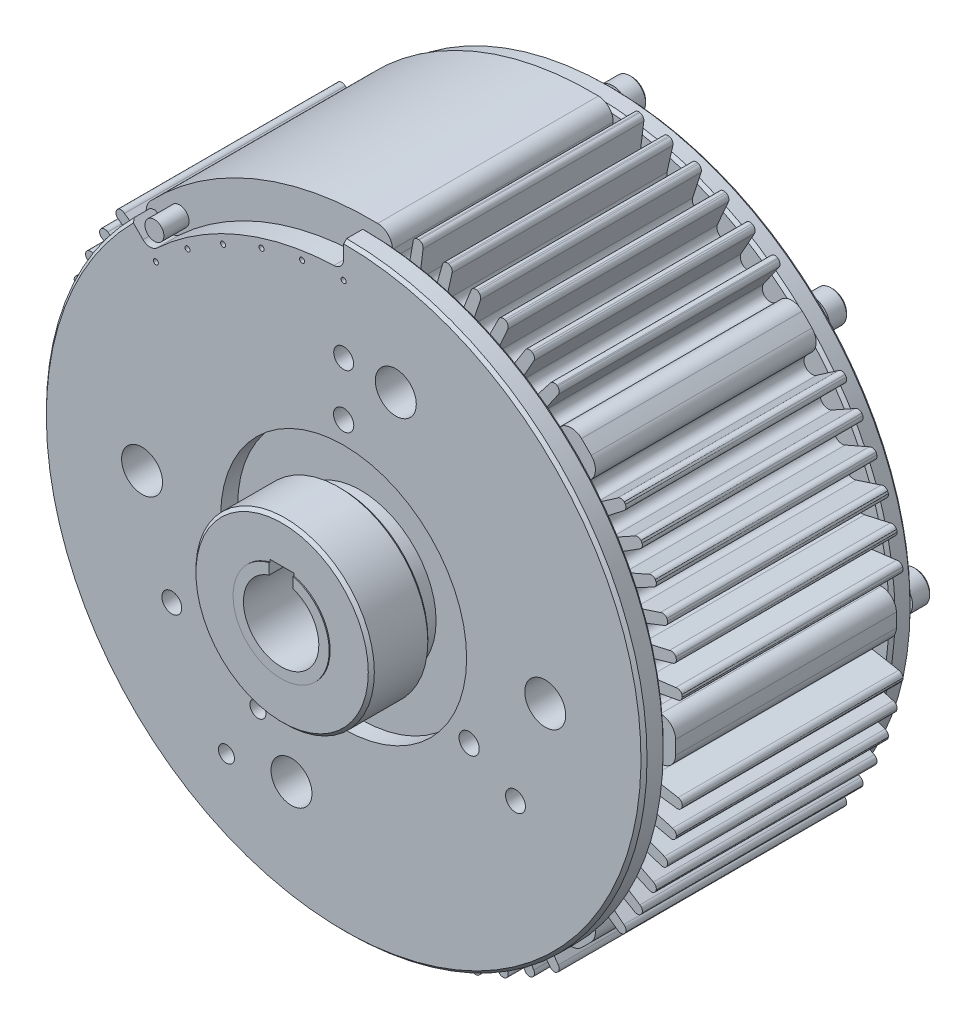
from build123d import *

# Parameters (mm, degrees)
SKETCH2_W                                 = 6
SKETCH2_H                                 = 8.49
CUT_EXTRUDE1_DEPTH                        = 154.466560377
F_1_4_20_TAPPED_HOLE1_AT_2_COUNT          = 2
F_1_4_20_TAPPED_HOLE1_AT_2_PITCH          = 63.241505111
F_1_4_20_TAPPED_HOLE1_AT_3_COUNT          = 2
F_1_4_20_TAPPED_HOLE1_AT_3_PITCH          = 63.241505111
M6X1_0_TAPPED_HOLE1_AT_2_COUNT            = 2
M6X1_0_TAPPED_HOLE1_AT_2_PITCH            = 86.602367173
M6X1_0_TAPPED_HOLE1_AT_3_COUNT            = 2
M6X1_0_TAPPED_HOLE1_AT_3_PITCH            = 86.602367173
F_13_32_0_40625_DIAMETER_HOLE1_D          = 10.31875
F_13_32_0_40625_DIAMETER_HOLE1_DEPTH      = 9.652
F_13_32_0_40625_DIAMETER_HOLE1_TIP        = 3.100065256
CIRPATTERN1_COUNT                         = 8
F_13_32_0_40625_DIAMETER_HOLE2_AT_2_COUNT = 2
F_13_32_0_40625_DIAMETER_HOLE2_AT_2_PITCH = 80.604699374
CIRPATTERN2_COUNT                         = 2
F_10_32_TAPPED_HOLE1_D                    = 4.0386
F_10_32_TAPPED_HOLE1_DEPTH                = 11.938
F_10_32_TAPPED_HOLE1_TIP                  = 1.213317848
SKETCH14_OUTSIDE_W                        = 210.29
SKETCH14_OUTSIDE_H                        = 210.29
CUT_EXTRUDE2_DEPTH                        = 55.626
CUT_EXTRUDE6_REACH                        = 144.198
SKETCH17_R                                = 0.635
SKETCH18_R                                = 2.3876
BOSS_EXTRUDE1_DEPTH                       = 6.35


with BuildPart() as part:
    # Sketch1 → Revolve1 (revolve)
    with BuildSketch(Plane(origin=(0, 0, 0), x_dir=(0, 0, -1), z_dir=(1, 0, 0)), mode=Mode.PRIVATE) as revolve1_sk:
        with BuildLine():
            Line((-15.754206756, 9.5), (-15.754206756, 12.108983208))
            Line((-15.754206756, 12.108983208), (-15.506, 12.108983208))
            Line((-15.506, 12.108983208), (-15.506, 21.717))
            Line((-15.506, 21.717), (-14.744, 22.479))
            Line((-14.744, 22.479), (-1.268, 22.479))
            Line((-1.268, 22.479), (-0.506, 21.717))
            Line((-0.506, 21.717), (-0.506, 19.029))
            Line((-0.506, 19.029), (4.2672, 19.029))
            Line((4.2672, 19.029), (4.2672, 30.99181))
            Line((4.2672, 30.99181), (0, 30.99181))
            Line((0, 30.99181), (0, 74.93))
            Line((0, 74.93), (0.762, 75.692))
            Line((0.762, 75.692), (4.826, 75.692))
            Line((4.826, 75.692), (5.588, 74.93))
            Line((5.588, 74.93), (5.588, 66.6115))
            Line((5.588, 66.6115), (6.848, 66.6115))
            Line((6.848, 66.6115), (6.848, 79.375))
            Line((6.848, 79.375), (62.474, 79.375))
            Line((62.474, 79.375), (62.474, 74.93))
            Line((62.474, 74.93), (63.236, 75.692))
            Line((63.236, 75.692), (67.046, 75.692))
            Line((67.046, 75.692), (67.808, 74.93))
            Line((67.808, 74.93), (67.808, 66.548))
            Line((67.808, 66.548), (71.872, 66.548))
            Line((71.872, 66.548), (72.634, 65.786))
            Line((72.634, 65.786), (72.634, 31.0007))
            Line((72.634, 31.0007), (75.652045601, 31.0007))
            Line((75.652045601, 31.0007), (76.463693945, 30.189051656))
            Line((76.463693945, 30.189051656), (76.463693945, 19.347690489))
            ThreePointArc((76.463693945, 19.347690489), (76.639104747, 19.863331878), (76.965370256, 20.299457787))
            Line((76.965370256, 20.299457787), (80.894994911, 24.114894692))
            Line((80.894994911, 24.114894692), (81.864862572, 23.173209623))
            Line((81.864862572, 23.173209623), (81.607463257, 22.098))
            Line((81.607463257, 22.098), (86.866125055, 22.098))
            ThreePointArc((86.866125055, 22.098), (87.93786431, 21.654071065), (88.381793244, 20.582331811))
            Line((88.381793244, 20.582331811), (88.381793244, 14.867163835))
            Line((88.381793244, 14.867163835), (88.893793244, 13.978425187))
            Line((88.893793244, 13.978425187), (88.893793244, 9.5))
            Line((88.893793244, 9.5), (-15.754206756, 9.5))
        make_face()
    revolve(revolve1_sk.sketch.rotate(Axis((0, 0, 38.095236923), (0, 0, -1)), 90), axis=Axis((0, 0, 38.095236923), (0, 0, -1)))

    # Sketch2 → Cut-Extrude1 (cut, through all)
    with BuildSketch(Plane(origin=(0, 0, -88.893793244), x_dir=(-1, 0, 0), z_dir=(0, 0, -1))):
        with Locations((0, 8.055)):
            Rectangle(SKETCH2_W, SKETCH2_H)
    extrude(amount=-CUT_EXTRUDE1_DEPTH, mode=Mode.SUBTRACT)

    # Sketch3 → 1_4-20 Tapped Hole1 (revolve, cut)
    with BuildSketch(Plane(origin=(-31.620752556, -18.25625, -72.634), x_dir=(0, 1, 0), z_dir=(1, 0, 0))):
        Polygon((0, 0), (0, 12.709816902), (2.5527, 11.176), (2.5527, 0), align=None)
    f_1_4_20_tapped_hole1 = revolve(axis=Axis((-31.620752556, -18.25625, -78.984), (0, 0, 1)), mode=Mode.SUBTRACT)

    # 1_4-20 Tapped Hole1 at 2: 1_4-20 Tapped Hole1 ×2
    with Locations(*[(i * F_1_4_20_TAPPED_HOLE1_AT_2_PITCH, 0, 0) for i in range(1, F_1_4_20_TAPPED_HOLE1_AT_2_COUNT)]):
        add(f_1_4_20_tapped_hole1, mode=Mode.SUBTRACT)

    # 1_4-20 Tapped Hole1 at 3: 1_4-20 Tapped Hole1 ×2
    with Locations(*[Vector(0.49999999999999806, 0.8660254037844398, 0) * (i * F_1_4_20_TAPPED_HOLE1_AT_3_PITCH) for i in range(1, F_1_4_20_TAPPED_HOLE1_AT_3_COUNT)]):
        add(f_1_4_20_tapped_hole1, mode=Mode.SUBTRACT)

    # Sketch5 → M6x1.0 Tapped Hole1 (revolve, cut)
    with BuildSketch(Plane(origin=(0, 49.9999, -72.634), x_dir=(0, 1, 0), z_dir=(1, 0, 0))):
        Polygon((0, 0), (0, 16.488151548), (2.5, 14.986), (2.5, 0), align=None)
    m6x1_0_tapped_hole1 = revolve(axis=Axis((0, 49.9999, -78.984), (0, 0, 1)), mode=Mode.SUBTRACT)

    # M6x1.0 Tapped Hole1 at 2: M6x1.0 Tapped Hole1 ×2
    with Locations(*[Vector(0.49999999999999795, -0.8660254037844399, 0) * (i * M6X1_0_TAPPED_HOLE1_AT_2_PITCH) for i in range(1, M6X1_0_TAPPED_HOLE1_AT_2_COUNT)]):
        add(m6x1_0_tapped_hole1, mode=Mode.SUBTRACT)

    # M6x1.0 Tapped Hole1 at 3: M6x1.0 Tapped Hole1 ×2
    with Locations(*[Vector(-0.49999999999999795, -0.8660254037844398, 0) * (i * M6X1_0_TAPPED_HOLE1_AT_3_PITCH) for i in range(1, M6X1_0_TAPPED_HOLE1_AT_3_COUNT)]):
        add(m6x1_0_tapped_hole1, mode=Mode.SUBTRACT)

    # 13_32 _0.40625_ Diameter Hole1
    with Locations(Plane(origin=(0, 0, -72.634), x_dir=(-1, 0, 0), z_dir=(0, 0, -1))):
        with Locations((50.8, 0), (-50.8, 0)):
            Hole(F_13_32_0_40625_DIAMETER_HOLE1_D / 2, depth=F_13_32_0_40625_DIAMETER_HOLE1_DEPTH)
            with Locations((0, 0, -(F_13_32_0_40625_DIAMETER_HOLE1_DEPTH + F_13_32_0_40625_DIAMETER_HOLE1_TIP / 2))):  # 118° drill point
                Cone(0, F_13_32_0_40625_DIAMETER_HOLE1_D / 2, F_13_32_0_40625_DIAMETER_HOLE1_TIP, mode=Mode.SUBTRACT)

    # Sketch9 → Revolve2 (revolve)
    with BuildSketch(Plane(origin=(0, 0, 0), x_dir=(0, 0, -1), z_dir=(1, 0, 0)), mode=Mode.PRIVATE) as revolve2_sk:
        Polygon((67.808, 75.55865), (72.126, 75.55865), (72.634, 75.05065), (72.634, 71.5899), (67.808, 71.5899), align=None)
    revolve2 = revolve(revolve2_sk.sketch.rotate(Axis((0, 71.5899, -41.060125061), (0, 0, -1)), 90), axis=Axis((0, 71.5899, -41.060125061), (0, 0, -1)))

    # CirPattern1: Revolve2 ×8 about axis
    cirpattern1_axis = Axis((0, 0, 0), (0, 0, 1))
    for i in range(1, CIRPATTERN1_COUNT):
        add(revolve2.rotate(cirpattern1_axis, i * 360 / CIRPATTERN1_COUNT))

    # Mirror1: 1_4-20 Tapped Hole1, M6x1.0 Tapped Hole1 across plane
    add(f_1_4_20_tapped_hole1.mirror(Plane(origin=(0, 0, -36.317), x_dir=(1, 0, 0), z_dir=(0, 0, -1))), mode=Mode.SUBTRACT)
    add(m6x1_0_tapped_hole1.mirror(Plane(origin=(0, 0, -36.317), x_dir=(1, 0, 0), z_dir=(0, 0, -1))), mode=Mode.SUBTRACT)

    # Mirror1 copy 1 sketch → Mirror1 copy 1 (revolve, cut)
    with BuildSketch(Plane(origin=(31.620752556, -18.25625, 0), x_dir=(0, 1, 0), z_dir=(1, 0, 0))):
        Polygon((0, 0), (0, -12.709816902), (2.5527, -11.176), (2.5527, 0), align=None)
    revolve(axis=Axis((31.620752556, -18.25625, 6.35), (0, 0, 1)), mode=Mode.SUBTRACT)

    # Mirror1 copy 2 sketch → Mirror1 copy 2 (revolve, cut)
    with BuildSketch(Plane(origin=(0, 36.5125, 0), x_dir=(0, 1, 0), z_dir=(1, 0, 0))):
        Polygon((0, 0), (0, -12.709816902), (2.5527, -11.176), (2.5527, 0), align=None)
    revolve(axis=Axis((0, 36.5125, 6.35), (0, 0, 1)), mode=Mode.SUBTRACT)

    # Mirror1 copy 3 sketch → Mirror1 copy 3 (revolve, cut)
    with BuildSketch(Plane(origin=(43.301183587, -24.99995, 0), x_dir=(0, 1, 0), z_dir=(1, 0, 0))):
        Polygon((0, 0), (0, -16.488151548), (2.5, -14.986), (2.5, 0), align=None)
    revolve(axis=Axis((43.301183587, -24.99995, 6.35), (0, 0, 1)), mode=Mode.SUBTRACT)

    # Mirror1 copy 4 sketch → Mirror1 copy 4 (revolve, cut)
    with BuildSketch(Plane(origin=(-43.301183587, -24.99995, 0), x_dir=(0, 1, 0), z_dir=(1, 0, 0))):
        Polygon((0, 0), (0, -16.488151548), (2.5, -14.986), (2.5, 0), align=None)
    revolve(axis=Axis((-43.301183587, -24.99995, 6.35), (0, 0, 1)), mode=Mode.SUBTRACT)

    # Sketch10 → 13_32 _0.40625_ Diameter Hole2 (revolve, cut)
    with BuildSketch(Plane(origin=(-50.8, 0, 0), x_dir=(0, -1, 0), z_dir=(1, 0, 0))):
        Polygon((0, 0), (0, 12.752065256), (5.159375, 9.652), (5.159375, 0), align=None)
    f_13_32_0_40625_diameter_hole2 = revolve(axis=Axis((-50.8, 0, 6.35), (0, 0, -1)), mode=Mode.SUBTRACT)

    # 13_32 _0.40625_ Diameter Hole2 at 2: 13_32 _0.40625_ Diameter Hole2 ×2
    with Locations(*[Vector(0.7933533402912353, 0.6087614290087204, 0) * (i * F_13_32_0_40625_DIAMETER_HOLE2_AT_2_PITCH) for i in range(1, F_13_32_0_40625_DIAMETER_HOLE2_AT_2_COUNT)]):
        add(f_13_32_0_40625_diameter_hole2, mode=Mode.SUBTRACT)

    # CirPattern2: 13_32 _0.40625_ Diameter Hole2 ×2 about axis
    cirpattern2_axis = Axis((0, 0, 0), (0, 0, 1))
    for i in range(1, CIRPATTERN2_COUNT):
        add(f_13_32_0_40625_diameter_hole2.rotate(cirpattern2_axis, i * 360 / CIRPATTERN2_COUNT), mode=Mode.SUBTRACT)

    # CirPattern2 copy 1 sketch → CirPattern2 copy 1 (revolve, cut)
    with BuildSketch(Plane(origin=(-13.148007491, -49.069031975, 0), x_dir=(0, 1, 0), z_dir=(-1, 0, 0))):
        Polygon((0, 0), (0, 12.752065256), (5.159375, 9.652), (5.159375, 0), align=None)
    revolve(axis=Axis((-13.148007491, -49.069031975, 6.35), (0, 0, -1)), mode=Mode.SUBTRACT)

    # 10-32 Tapped Hole1
    with Locations(Plane.XY):
        with Locations((-21.59, -37.3888), (-29.5402, -51.1556)):
            Hole(F_10_32_TAPPED_HOLE1_D / 2, depth=F_10_32_TAPPED_HOLE1_DEPTH)
            with Locations((0, 0, -(F_10_32_TAPPED_HOLE1_DEPTH + F_10_32_TAPPED_HOLE1_TIP / 2))):  # 118° drill point
                Cone(0, F_10_32_TAPPED_HOLE1_D / 2, F_10_32_TAPPED_HOLE1_TIP, mode=Mode.SUBTRACT)

    # Sketch14 outside → Cut-Extrude2 (cut)
    with BuildSketch(Plane.XY.offset(-6.848)):
        Rectangle(SKETCH14_OUTSIDE_W, SKETCH14_OUTSIDE_H)
        with BuildLine():
            Line((10.64243444, 77.196331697), (9.453260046, 70.715791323))
            ThreePointArc((9.453260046, 70.715791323), (7.275354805, 68.9015165), (5.461079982, 71.07942174))
            Line((5.461079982, 71.07942174), (5.461079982, 73.009870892))
            ThreePointArc((5.461079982, 73.009870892), (4.375441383, 75.673318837), (1.737219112, 76.818897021))
            ThreePointArc((1.737219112, 76.818897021), (0.868665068, 76.833627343), (0, 76.83853766))
            ThreePointArc((0, 76.83853766), (-30.202937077, 70.653686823), (-55.543713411, 53.094790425))
            ThreePointArc((-55.543713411, 53.094790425), (-56.598420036, 50.418010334), (-55.478838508, 47.767709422))
            Line((-55.478838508, 47.767709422), (-53.924633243, 46.185729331))
            ThreePointArc((-53.924633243, 46.185729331), (-54.082997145, 43.616948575), (-56.644481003, 43.366920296))
            Line((-56.644481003, 43.366920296), (-62.058491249, 47.082630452))
            ThreePointArc((-62.058491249, 47.082630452), (-63.920430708, 47.011508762), (-63.707480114, 45.160420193))
            Line((-63.707480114, 45.160420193), (-58.150806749, 40.835928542))
            ThreePointArc((-58.150806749, 40.835928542), (-57.970497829, 38.240802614), (-60.51575317, 37.703340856))
            Line((-60.51575317, 37.703340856), (-66.285279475, 40.914874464))
            ThreePointArc((-66.285279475, 40.914874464), (-68.131830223, 40.665621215), (-67.742441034, 38.8434651))
            Line((-67.742441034, 38.8434651), (-61.796865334, 35.071466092))
            ThreePointArc((-61.796865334, 35.071466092), (-61.368654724, 32.505569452), (-63.850678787, 31.726630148))
            Line((-63.850678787, 31.726630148), (-69.901455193, 34.370393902))
            ThreePointArc((-69.901455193, 34.370393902), (-71.715614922, 33.945304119), (-71.15337248, 32.16885815))
            Line((-71.15337248, 32.16885815), (-64.873638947, 28.984082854))
            ThreePointArc((-64.873638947, 28.984082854), (-64.201469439, 26.471041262), (-66.597408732, 25.457796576))
            Line((-66.597408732, 25.457796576), (-72.873722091, 27.509447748))
            ThreePointArc((-72.873722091, 27.509447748), (-74.638786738, 26.91243549), (-73.908867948, 25.198056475))
            Line((-73.908867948, 25.198056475), (-67.352797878, 22.629829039))
            ThreePointArc((-67.352797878, 22.629829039), (-66.442858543, 20.192781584), (-68.730652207, 18.954561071))
            Line((-68.730652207, 18.954561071), (-75.174712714, 20.395208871))
            ThreePointArc((-75.174712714, 20.395208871), (-76.874430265, 19.631771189), (-75.983555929, 17.995244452))
            Line((-75.983555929, 17.995244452), (-69.211515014, 16.067212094))
            ThreePointArc((-69.211515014, 16.067212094), (-68.072184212, 13.728598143), (-70.230767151, 12.276802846))
            Line((-70.230767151, 12.276802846), (-76.783240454, 13.093182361))
            ThreePointArc((-76.783240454, 13.093182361), (-78.401960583, 12.170348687), (-77.35833352, 10.626742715))
            Line((-77.35833352, 10.626742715), (-70.690488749, 9.417234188))
            ThreePointArc((-70.690488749, 9.417234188), (-69.07368089, 7.268394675), (-71.062054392, 5.457883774))
            Line((-71.062054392, 5.457883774), (-73.013132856, 5.457883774))
            ThreePointArc((-73.013132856, 5.457883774), (-75.674300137, 4.37317471), (-76.818897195, 1.73721139))
            ThreePointArc((-76.818897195, 1.73721139), (-76.833627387, 0.868661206), (-76.83853766, 0))
            ThreePointArc((-76.83853766, 0), (-76.833627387, -0.868661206), (-76.818897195, -1.73721139))
            ThreePointArc((-76.818897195, -1.73721139), (-75.674300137, -4.37317471), (-73.013132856, -5.457883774))
            Line((-73.013132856, -5.457883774), (-71.062054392, -5.457883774))
            ThreePointArc((-71.062054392, -5.457883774), (-69.039267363, -7.268374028), (-70.690488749, -9.423138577))
            Line((-70.690488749, -9.423138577), (-77.358333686, -10.626023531))
            ThreePointArc((-77.358333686, -10.626023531), (-78.401960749, -12.169629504), (-76.78324062, -13.092463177))
            Line((-76.78324062, -13.092463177), (-70.230767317, -12.276083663))
            ThreePointArc((-70.230767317, -12.276083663), (-68.072184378, -13.72787896), (-69.21151518, -16.066492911))
            Line((-69.21151518, -16.066492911), (-75.983556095, -17.994525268))
            ThreePointArc((-75.983556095, -17.994525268), (-76.874430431, -19.631052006), (-75.17471288, -20.394489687))
            Line((-75.17471288, -20.394489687), (-68.730652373, -18.953841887))
            ThreePointArc((-68.730652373, -18.953841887), (-66.442858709, -20.192062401), (-67.352798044, -22.629109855))
            Line((-67.352798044, -22.629109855), (-73.908868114, -25.197337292))
            ThreePointArc((-73.908868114, -25.197337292), (-74.638786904, -26.911716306), (-72.873722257, -27.508728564))
            Line((-72.873722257, -27.508728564), (-66.597408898, -25.457077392))
            ThreePointArc((-66.597408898, -25.457077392), (-64.201469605, -26.470322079), (-64.873639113, -28.98336367))
            Line((-64.873639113, -28.98336367), (-71.153372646, -32.168138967))
            ThreePointArc((-71.153372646, -32.168138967), (-71.715615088, -33.944584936), (-69.901455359, -34.369674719))
            Line((-69.901455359, -34.369674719), (-63.850678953, -31.725910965))
            ThreePointArc((-63.850678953, -31.725910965), (-61.36865489, -32.504850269), (-61.7968655, -35.070746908))
            Line((-61.7968655, -35.070746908), (-67.7424412, -38.842745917))
            ThreePointArc((-67.7424412, -38.842745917), (-68.131830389, -40.664902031), (-66.285279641, -40.91415528))
            Line((-66.285279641, -40.91415528), (-60.515753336, -37.702621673))
            ThreePointArc((-60.515753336, -37.702621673), (-57.970497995, -38.240083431), (-58.150806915, -40.835209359))
            Line((-58.150806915, -40.835209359), (-63.70748028, -45.159701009))
            ThreePointArc((-63.70748028, -45.159701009), (-63.920430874, -47.010789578), (-62.058491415, -47.081911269))
            Line((-62.058491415, -47.081911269), (-56.644481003, -43.331059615))
            ThreePointArc((-56.644481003, -43.331059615), (-53.976055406, -43.696516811), (-54.0982095, -46.387080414))
            Line((-54.0982095, -46.387080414), (-55.478838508, -47.767709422))
            ThreePointArc((-55.478838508, -47.767709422), (-56.598420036, -50.418010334), (-55.543713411, -53.094790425))
            ThreePointArc((-55.543713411, -53.094790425), (-54.33372791, -54.332374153), (-53.096174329, -55.54239049))
            ThreePointArc((-53.096174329, -55.54239049), (-50.431208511, -56.597828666), (-47.785022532, -55.496151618))
            Line((-47.785022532, -55.496151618), (-46.417914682, -54.129043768))
            ThreePointArc((-46.417914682, -54.129043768), (-43.675735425, -53.975368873), (-43.296849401, -56.695591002))
            Line((-43.296849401, -56.695591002), (-47.176474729, -62.253165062))
            ThreePointArc((-47.176474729, -62.253165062), (-46.822936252, -64.082615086), (-45.025786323, -63.590549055))
            Line((-45.025786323, -63.590549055), (-40.970860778, -58.36285486))
            ThreePointArc((-40.970860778, -58.36285486), (-38.417937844, -57.863080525), (-37.569916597, -60.322358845))
            Line((-37.569916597, -60.322358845), (-40.909667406, -66.47423892))
            ThreePointArc((-40.909667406, -66.47423892), (-40.468158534, -68.179518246), (-38.804941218, -67.599332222))
            Line((-38.804941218, -67.599332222), (-35.266994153, -62.02400151))
            ThreePointArc((-35.266994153, -62.02400151), (-32.695576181, -61.208288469), (-31.545421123, -63.648518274))
            Line((-31.545421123, -63.648518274), (-34.365251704, -70.10037093))
            ThreePointArc((-34.365251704, -70.10037093), (-33.739010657, -71.761338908), (-32.13413357, -71.002812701))
            Line((-32.13413357, -71.002812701), (-29.146846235, -65.114052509))
            ThreePointArc((-29.146846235, -65.114052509), (-26.671056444, -64.074298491), (-25.309248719, -66.388624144))
            Line((-25.309248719, -66.388624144), (-27.497714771, -73.081042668))
            ThreePointArc((-27.497714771, -73.081042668), (-26.698963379, -74.676495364), (-25.172611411, -73.752524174))
            Line((-25.172611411, -73.752524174), (-22.666715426, -67.357592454))
            ThreePointArc((-22.666715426, -67.357592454), (-20.360866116, -66.153329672), (-18.849293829, -68.270483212))
            Line((-18.849293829, -68.270483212), (-20.425888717, -75.388809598))
            ThreePointArc((-20.425888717, -75.388809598), (-19.412769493, -76.952608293), (-17.93081226, -75.823148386))
            Line((-17.93081226, -75.823148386), (-16.122036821, -69.472580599))
            ThreePointArc((-16.122036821, -69.472580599), (-13.942226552, -68.052856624), (-12.234693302, -70.015385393))
            Line((-12.234693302, -70.015385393), (-13.105978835, -77.002423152))
            ThreePointArc((-13.105978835, -77.002423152), (-11.947640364, -78.461919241), (-10.580759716, -77.195619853))
            Line((-10.580759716, -77.195619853), (-9.391585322, -70.715079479))
            ThreePointArc((-9.391585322, -70.715079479), (-7.270029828, -69.211872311), (-5.460917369, -71.079421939))
            Line((-5.460917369, -71.079421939), (-5.460917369, -73.009870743))
            ThreePointArc((-5.460917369, -73.009870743), (-4.375335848, -75.6732619), (-1.737219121, -76.81889702))
            ThreePointArc((-1.737219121, -76.81889702), (-0.868665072, -76.833627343), (0, -76.83853766))
            ThreePointArc((0, -76.83853766), (0.868665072, -76.833627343), (1.737219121, -76.81889702))
            ThreePointArc((1.737219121, -76.81889702), (4.377916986, -75.67079084), (5.461079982, -73.002797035))
            Line((5.461079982, -73.002797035), (5.461079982, -71.079421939))
            ThreePointArc((5.461079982, -71.079421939), (7.274998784, -68.901160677), (9.453260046, -70.715079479))
            Line((9.453260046, -70.715079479), (10.64243444, -77.195619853))
            ThreePointArc((10.64243444, -77.195619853), (12.009315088, -78.461919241), (13.167653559, -77.002423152))
            Line((13.167653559, -77.002423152), (12.296369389, -70.015385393))
            ThreePointArc((12.296369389, -70.015385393), (14.003902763, -68.052856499), (16.183713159, -69.472580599))
            Line((16.183713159, -69.472580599), (17.992487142, -75.823148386))
            ThreePointArc((17.992487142, -75.823148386), (19.47444436, -76.952608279), (20.487563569, -75.388809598))
            Line((20.487563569, -75.388809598), (18.990249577, -68.270483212))
            ThreePointArc((18.990249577, -68.270483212), (20.501821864, -66.153329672), (22.807671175, -67.357592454))
            Line((22.807671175, -67.357592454), (25.177156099, -73.752524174))
            ThreePointArc((25.177156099, -73.752524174), (26.760544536, -74.734744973), (27.619116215, -73.081042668))
            Line((27.619116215, -73.081042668), (25.430650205, -66.388624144))
            ThreePointArc((25.430650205, -66.388624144), (26.732343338, -64.136339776), (29.143000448, -65.114052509))
            Line((29.143000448, -65.114052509), (32.130287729, -71.002812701))
            ThreePointArc((32.130287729, -71.002812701), (33.800528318, -71.82875047), (34.496646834, -70.10037093))
            Line((34.496646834, -70.10037093), (31.676816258, -63.648518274))
            ThreePointArc((31.676816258, -63.648518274), (32.756644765, -61.281841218), (35.2499133, -62.02400151))
            Line((35.2499133, -62.02400151), (38.787860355, -67.599332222))
            ThreePointArc((38.787860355, -67.599332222), (40.529574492, -68.261381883), (41.056829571, -66.47423892))
            Line((41.056829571, -66.47423892), (37.631596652, -60.322358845))
            ThreePointArc((37.631596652, -60.322358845), (38.479617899, -57.863080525), (41.032540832, -58.36285486))
            Line((41.032540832, -58.36285486), (45.089676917, -63.590549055))
            ThreePointArc((45.089676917, -63.590549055), (46.886826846, -64.082615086), (47.240365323, -62.253165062))
            Line((47.240365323, -62.253165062), (43.376063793, -56.695591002))
            ThreePointArc((43.376063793, -56.695591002), (43.717872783, -54.014838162), (46.417914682, -54.129043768))
            Line((46.417914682, -54.129043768), (47.785022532, -55.496151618))
            ThreePointArc((47.785022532, -55.496151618), (50.431208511, -56.597828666), (53.096174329, -55.54239049))
            ThreePointArc((53.096174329, -55.54239049), (54.33372791, -54.332374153), (55.543713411, -53.094790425))
            ThreePointArc((55.543713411, -53.094790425), (56.598420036, -50.418010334), (55.478838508, -47.767709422))
            Line((55.478838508, -47.767709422), (54.0982095, -46.387080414))
            ThreePointArc((54.0982095, -46.387080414), (54.019588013, -43.648559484), (56.740777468, -43.331059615))
            Line((56.740777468, -43.331059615), (62.120167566, -47.081909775))
            ThreePointArc((62.120167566, -47.081909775), (63.982107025, -47.010788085), (63.769156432, -45.159699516))
            Line((63.769156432, -45.159699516), (58.212483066, -40.835207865))
            ThreePointArc((58.212483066, -40.835207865), (58.032174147, -38.240081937), (60.577429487, -37.702620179))
            Line((60.577429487, -37.702620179), (66.346955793, -40.914153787))
            ThreePointArc((66.346955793, -40.914153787), (68.19350654, -40.664900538), (67.804117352, -38.842744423))
            Line((67.804117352, -38.842744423), (61.858541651, -35.070745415))
            ThreePointArc((61.858541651, -35.070745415), (61.430331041, -32.504848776), (63.912355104, -31.725909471))
            Line((63.912355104, -31.725909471), (69.96313151, -34.369673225))
            ThreePointArc((69.96313151, -34.369673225), (71.777291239, -33.944583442), (71.215048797, -32.168137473))
            Line((71.215048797, -32.168137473), (64.935315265, -28.983362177))
            ThreePointArc((64.935315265, -28.983362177), (64.263145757, -26.470320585), (66.65908505, -25.457075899))
            Line((66.65908505, -25.457075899), (72.935398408, -27.508727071))
            ThreePointArc((72.935398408, -27.508727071), (74.700463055, -26.911714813), (73.970544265, -25.197335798))
            Line((73.970544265, -25.197335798), (67.414474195, -22.629108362))
            ThreePointArc((67.414474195, -22.629108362), (66.50453486, -20.192060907), (68.792328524, -18.953840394))
            Line((68.792328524, -18.953840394), (75.236389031, -20.394488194))
            ThreePointArc((75.236389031, -20.394488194), (76.936106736, -19.631050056), (76.045231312, -17.994523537))
            Line((76.045231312, -17.994523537), (69.273189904, -16.066492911))
            ThreePointArc((69.273189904, -16.066492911), (68.133859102, -13.72787896), (70.292442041, -12.276083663))
            Line((70.292442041, -12.276083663), (76.844915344, -13.092463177))
            ThreePointArc((76.844915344, -13.092463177), (78.463635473, -12.169629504), (77.42000841, -10.626023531))
            Line((77.42000841, -10.626023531), (70.715529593, -9.423138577))
            ThreePointArc((70.715529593, -9.423138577), (69.083273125, -7.280312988), (71.069809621, -5.461072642))
            Line((71.069809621, -5.461072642), (73.009871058, -5.461072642))
            ThreePointArc((73.009871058, -5.461072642), (75.67331914, -4.37543391), (76.818897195, -1.73721139))
            ThreePointArc((76.818897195, -1.73721139), (76.833627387, -0.868661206), (76.83853766, 0))
            ThreePointArc((76.83853766, 0), (76.833627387, 0.868661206), (76.818897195, 1.73721139))
            ThreePointArc((76.818897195, 1.73721139), (75.672204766, 4.373363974), (73.009871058, 5.457883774))
            Line((73.009871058, 5.457883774), (71.069809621, 5.457883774))
            ThreePointArc((71.069809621, 5.457883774), (69.082225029, 7.27556161), (70.715529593, 9.417234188))
            Line((70.715529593, 9.417234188), (77.420008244, 10.626742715))
            ThreePointArc((77.420008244, 10.626742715), (78.463635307, 12.170348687), (76.844915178, 13.093182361))
            Line((76.844915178, 13.093182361), (70.292441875, 12.276802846))
            ThreePointArc((70.292441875, 12.276802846), (68.133858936, 13.728598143), (69.273189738, 16.067212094))
            Line((69.273189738, 16.067212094), (76.045233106, 17.995235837))
            ThreePointArc((76.045233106, 17.995235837), (76.93610644, 19.631762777), (75.236389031, 20.395200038))
            Line((75.236389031, 20.395200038), (68.792328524, 18.954552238))
            ThreePointArc((68.792328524, 18.954552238), (66.50453486, 20.192772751), (67.414474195, 22.629820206))
            Line((67.414474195, 22.629820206), (73.970544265, 25.198047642))
            ThreePointArc((73.970544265, 25.198047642), (74.700463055, 26.912426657), (72.935398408, 27.509438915))
            Line((72.935398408, 27.509438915), (66.65908505, 25.457787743))
            ThreePointArc((66.65908505, 25.457787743), (64.263145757, 26.471032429), (64.935315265, 28.984074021))
            Line((64.935315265, 28.984074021), (71.215048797, 32.168849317))
            ThreePointArc((71.215048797, 32.168849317), (71.777291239, 33.945295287), (69.96313151, 34.370385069))
            Line((69.96313151, 34.370385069), (63.912355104, 31.726621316))
            ThreePointArc((63.912355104, 31.726621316), (61.430331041, 32.50556062), (61.858541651, 35.071457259))
            Line((61.858541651, 35.071457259), (67.804117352, 38.843456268))
            ThreePointArc((67.804117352, 38.843456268), (68.19350654, 40.665612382), (66.346955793, 40.914865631))
            Line((66.346955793, 40.914865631), (60.577429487, 37.703332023))
            ThreePointArc((60.577429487, 37.703332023), (58.032174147, 38.240793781), (58.212483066, 40.83591971))
            Line((58.212483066, 40.83591971), (63.769156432, 45.16041136))
            ThreePointArc((63.769156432, 45.16041136), (63.982107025, 47.011499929), (62.120167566, 47.08262162))
            Line((62.120167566, 47.08262162), (56.740777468, 43.366920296))
            ThreePointArc((56.740777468, 43.366920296), (54.037449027, 43.667744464), (54.0982095, 46.387080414))
            Line((54.0982095, 46.387080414), (55.478838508, 47.767709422))
            ThreePointArc((55.478838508, 47.767709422), (56.598420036, 50.418010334), (55.543713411, 53.094790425))
            ThreePointArc((55.543713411, 53.094790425), (54.33372791, 54.332374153), (53.096174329, 55.54239049))
            ThreePointArc((53.096174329, 55.54239049), (50.431208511, 56.597828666), (47.785022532, 55.496151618))
            Line((47.785022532, 55.496151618), (46.417914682, 54.129043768))
            ThreePointArc((46.417914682, 54.129043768), (43.738509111, 53.996061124), (43.376063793, 56.654167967))
            Line((43.376063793, 56.654167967), (47.240365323, 62.219623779))
            ThreePointArc((47.240365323, 62.219623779), (46.886826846, 64.049073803), (45.089676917, 63.557007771))
            Line((45.089676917, 63.557007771), (41.032540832, 58.363570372))
            ThreePointArc((41.032540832, 58.363570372), (38.479617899, 57.863796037), (37.631596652, 60.323074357))
            Line((37.631596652, 60.323074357), (41.056829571, 66.474951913))
            ThreePointArc((41.056829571, 66.474951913), (40.529574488, 68.262094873), (38.787860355, 67.600045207))
            Line((38.787860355, 67.600045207), (35.2499133, 62.024714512))
            ThreePointArc((35.2499133, 62.024714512), (32.756644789, 61.282554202), (31.676816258, 63.649231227))
            Line((31.676816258, 63.649231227), (34.496646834, 70.101083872))
            ThreePointArc((34.496646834, 70.101083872), (33.800528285, 71.829463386), (32.130287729, 71.003525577))
            Line((32.130287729, 71.003525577), (29.143000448, 65.114765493))
            ThreePointArc((29.143000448, 65.114765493), (26.732343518, 64.137052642), (25.430650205, 66.389336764))
            Line((25.430650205, 66.389336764), (27.619116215, 73.081755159))
            ThreePointArc((27.619116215, 73.081755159), (26.76054428, 74.735457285), (25.177156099, 73.753236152))
            Line((25.177156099, 73.753236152), (22.807671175, 67.852234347))
            ThreePointArc((22.807671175, 67.852234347), (20.501831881, 66.647966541), (18.990249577, 68.765104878))
            Line((18.990249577, 68.765104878), (20.487563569, 75.389521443))
            ThreePointArc((20.487563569, 75.389521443), (19.47444436, 76.953320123), (17.992487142, 75.82386023))
            Line((17.992487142, 75.82386023), (16.183713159, 69.473290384))
            ThreePointArc((16.183713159, 69.473290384), (14.003902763, 68.053566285), (12.296369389, 70.016095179))
            Line((12.296369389, 70.016095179), (13.167653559, 77.003134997))
            ThreePointArc((13.167653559, 77.003134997), (12.009315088, 78.462631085), (10.64243444, 77.196331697))
        make_face(mode=Mode.SUBTRACT)
    extrude(amount=-CUT_EXTRUDE2_DEPTH, mode=Mode.SUBTRACT)

    # Cut-Extrude6: up to this face of the body (flat: up to its plane)
    cut_extrude6_end = Plane(part.part.faces().sort_by_distance((-72.810659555, 0, -5.588))[0])
    # Sketch17 → Cut-Extrude6 (cut, up to the picked face)
    with BuildSketch(Plane.XY, mode=Mode.PRIVATE) as cut_extrude6_sk1:
        with Locations((-47.325949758, 47.325949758)):
            Circle(SKETCH17_R)
    cut_extrude6_tool1 = split(extrude(cut_extrude6_sk1.sketch, amount=-CUT_EXTRUDE6_REACH, mode=Mode.PRIVATE), bisect_by=cut_extrude6_end, keep=Keep.BOTH, mode=Mode.PRIVATE)
    # Sketch17 → Cut-Extrude6 (cut, up to the picked face)
    with BuildSketch(Plane.XY, mode=Mode.PRIVATE) as cut_extrude6_sk2:
        with Locations((-39.339879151, 54.146698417)):
            Circle(SKETCH17_R)
    cut_extrude6_tool2 = split(extrude(cut_extrude6_sk2.sketch, amount=-CUT_EXTRUDE6_REACH, mode=Mode.PRIVATE), bisect_by=cut_extrude6_end, keep=Keep.BOTH, mode=Mode.PRIVATE)
    # Sketch17 → Cut-Extrude6 (cut, up to the picked face)
    with BuildSketch(Plane.XY, mode=Mode.PRIVATE) as cut_extrude6_sk3:
        with Locations((-30.385130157, 59.634175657)):
            Circle(SKETCH17_R)
    cut_extrude6_tool3 = split(extrude(cut_extrude6_sk3.sketch, amount=-CUT_EXTRUDE6_REACH, mode=Mode.PRIVATE), bisect_by=cut_extrude6_end, keep=Keep.BOTH, mode=Mode.PRIVATE)
    # Sketch17 → Cut-Extrude6 (cut, up to the picked face)
    with BuildSketch(Plane.XY, mode=Mode.PRIVATE) as cut_extrude6_sk4:
        with Locations((-20.682198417, 63.653261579)):
            Circle(SKETCH17_R)
    cut_extrude6_tool4 = split(extrude(cut_extrude6_sk4.sketch, amount=-CUT_EXTRUDE6_REACH, mode=Mode.PRIVATE), bisect_by=cut_extrude6_end, keep=Keep.BOTH, mode=Mode.PRIVATE)
    # Sketch17 → Cut-Extrude6 (cut, up to the picked face)
    with BuildSketch(Plane.XY, mode=Mode.PRIVATE) as cut_extrude6_sk5:
        with Locations((-10.470002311, 66.104992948)):
            Circle(SKETCH17_R)
    cut_extrude6_tool5 = split(extrude(cut_extrude6_sk5.sketch, amount=-CUT_EXTRUDE6_REACH, mode=Mode.PRIVATE), bisect_by=cut_extrude6_end, keep=Keep.BOTH, mode=Mode.PRIVATE)
    # Sketch17 → Cut-Extrude6 (cut, up to the picked face)
    with BuildSketch(Plane.XY, mode=Mode.PRIVATE) as cut_extrude6_sk6:
        with Locations((0, 66.929)):
            Circle(SKETCH17_R)
    cut_extrude6_tool6 = split(extrude(cut_extrude6_sk6.sketch, amount=-CUT_EXTRUDE6_REACH, mode=Mode.PRIVATE), bisect_by=cut_extrude6_end, keep=Keep.BOTH, mode=Mode.PRIVATE)
    # Sketch17 → Cut-Extrude6 (cut, up to the picked face)
    with BuildSketch(Plane.XY, mode=Mode.PRIVATE) as cut_extrude6_sk7:
        with BuildLine():
            Line((0, 71.506702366), (0, 82.16352584))
            Line((0, 82.16352584), (-65.291447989, 65.291447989))
            Line((-65.291447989, 65.291447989), (-50.562874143, 50.562874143))
            ThreePointArc((-50.562874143, 50.562874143), (-48.811913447, 49.819325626), (-47.035661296, 50.500248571))
            ThreePointArc((-47.035661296, 50.500248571), (-26.409672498, 63.758589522), (-2.449833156, 68.968303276))
            ThreePointArc((-2.449833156, 68.968303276), (-0.712347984, 69.742817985), (0, 71.506702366))
        make_face()
    cut_extrude6_tool7 = split(extrude(cut_extrude6_sk7.sketch, amount=-CUT_EXTRUDE6_REACH, mode=Mode.PRIVATE), bisect_by=cut_extrude6_end, keep=Keep.BOTH, mode=Mode.PRIVATE)
    add(cut_extrude6_tool1.solids().sort_by(Axis((-47.32595, 47.32595, 0), (0, 0, -1)))[0], mode=Mode.SUBTRACT)
    add(cut_extrude6_tool2.solids().sort_by(Axis((-39.339879, 54.146698, 0), (0, 0, -1)))[0], mode=Mode.SUBTRACT)
    add(cut_extrude6_tool3.solids().sort_by(Axis((-30.38513, 59.634176, 0), (0, 0, -1)))[0], mode=Mode.SUBTRACT)
    add(cut_extrude6_tool4.solids().sort_by(Axis((-20.682198, 63.653262, 0), (0, 0, -1)))[0], mode=Mode.SUBTRACT)
    add(cut_extrude6_tool5.solids().sort_by(Axis((-10.470002, 66.104993, 0), (0, 0, -1)))[0], mode=Mode.SUBTRACT)
    add(cut_extrude6_tool6.solids().sort_by(Axis((0, 66.929, 0), (0, 0, -1)))[0], mode=Mode.SUBTRACT)
    add(cut_extrude6_tool7.solids().sort_by(Axis((-32.398578, 66.979949, 0), (0, 0, -1)))[0], mode=Mode.SUBTRACT)

    # Sketch18 → Boss-Extrude1 (add)
    with BuildSketch(Plane.XY.offset(-6.848)):
        with Locations(Location((-48.183425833, 53.513115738, 0), (0, 0, 180))):
            Circle(SKETCH18_R)
    extrude(amount=BOSS_EXTRUDE1_DEPTH)


solid = part.part
